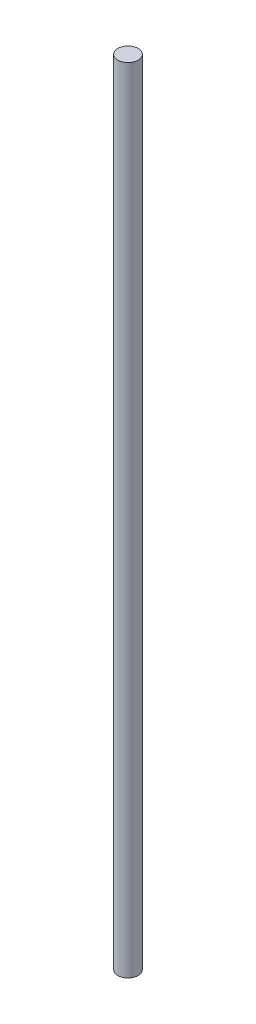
from build123d import *

# Parameters (mm, degrees)
SKETCH1_W = 3.175
SKETCH1_H = 247.65


with BuildPart() as part:
    # Sketch1 → Revolve1 (revolve)
    with BuildSketch(Plane.XY, mode=Mode.PRIVATE) as revolve1_sk:
        with Locations((1.5875, 123.825)):
            Rectangle(SKETCH1_W, SKETCH1_H)
    revolve(revolve1_sk.sketch.rotate(Axis((0, 0, 0), (0, 1, 0)), 90), axis=Axis((0, 0, 0), (0, 1, 0)))


solid = part.part
